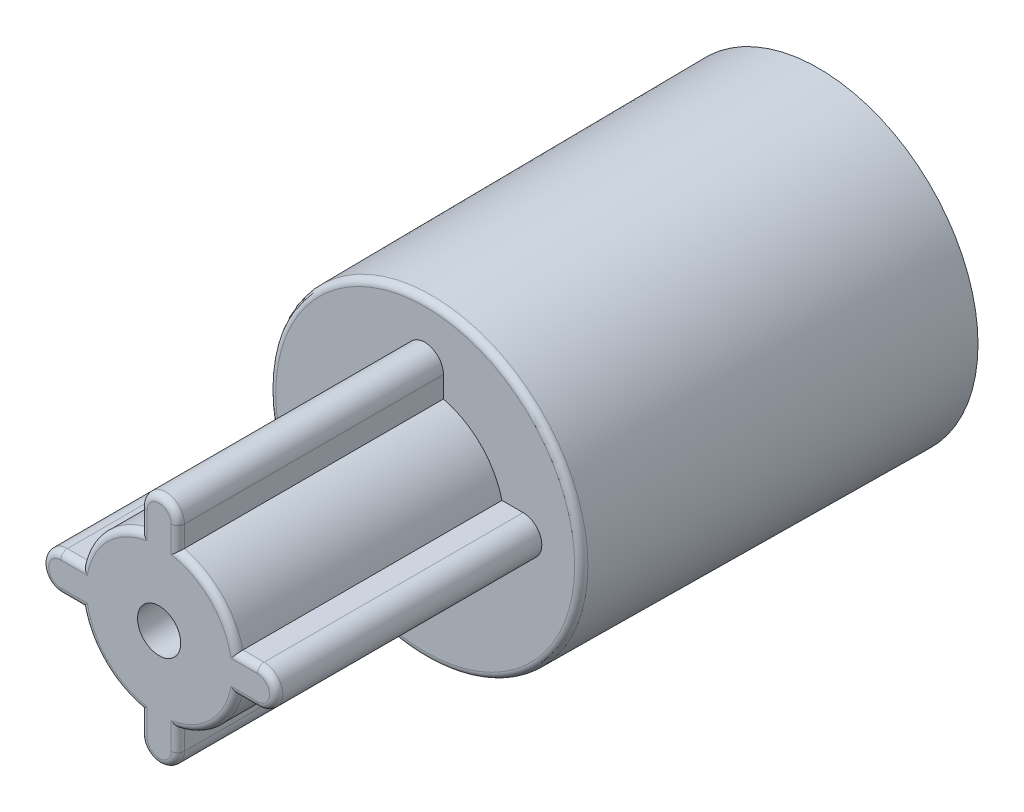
from build123d import *

# Parameters (mm, degrees)
SKETCH1_R           = 9.6
BASE_EXTRUDE_DEPTH  = 23.7
CUT_EXTRUDE1_DEPTH  = 21.7
BOSS_EXTRUDE1_DEPTH = 16
SKETCH4_R           = 1.3
CUT_EXTRUDE2_DEPTH  = 42.957240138
FILLET4_R           = 0.4


with BuildPart() as part:
    # Sketch1 → Base-Extrude (new body)
    with BuildSketch(Plane.XY):
        Circle(SKETCH1_R)
    extrude(amount=BASE_EXTRUDE_DEPTH)

    # Sketch2 → Cut-Extrude1 (cut)
    with BuildSketch(Plane(origin=(0, 0, 0), x_dir=(-1, 0, 0), z_dir=(0, 0, -1))):
        with BuildLine():
            Line((1.151331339, 6.016608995), (1.151331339, 4.741608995))
            ThreePointArc((1.151331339, 4.741608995), (3.409837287, 3.474244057), (4.677202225, 1.215738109))
            Line((4.677202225, 1.215738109), (5.952202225, 1.215738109))
            ThreePointArc((5.952202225, 1.215738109), (6.747697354, 0.886233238), (7.077202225, 0.090738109))
            ThreePointArc((7.077202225, 0.090738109), (6.747697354, -0.70475702), (5.952202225, -1.034261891))
            Line((5.952202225, -1.034261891), (4.677202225, -1.034261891))
            ThreePointArc((4.677202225, -1.034261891), (3.409837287, -3.292767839), (1.151331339, -4.560132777))
            Line((1.151331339, -4.560132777), (1.151331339, -5.835132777))
            ThreePointArc((1.151331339, -5.835132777), (0.026331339, -6.960132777), (-1.098668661, -5.835132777))
            Line((-1.098668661, -5.835132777), (-1.098668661, -4.560132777))
            ThreePointArc((-1.098668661, -4.560132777), (-3.357174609, -3.292767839), (-4.624539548, -1.034261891))
            Line((-4.624539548, -1.034261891), (-5.899539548, -1.034261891))
            ThreePointArc((-5.899539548, -1.034261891), (-6.695034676, -0.70475702), (-7.024539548, 0.090738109))
            ThreePointArc((-7.024539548, 0.090738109), (-6.695034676, 0.886233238), (-5.899539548, 1.215738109))
            Line((-5.899539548, 1.215738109), (-4.624539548, 1.215738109))
            ThreePointArc((-4.624539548, 1.215738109), (-3.357174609, 3.474244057), (-1.098668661, 4.741608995))
            Line((-1.098668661, 4.741608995), (-1.098668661, 6.016608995))
            ThreePointArc((-1.098668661, 6.016608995), (-0.76916379, 6.812104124), (0.026331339, 7.141608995))
            ThreePointArc((0.026331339, 7.141608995), (0.821826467, 6.812104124), (1.151331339, 6.016608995))
        make_face()
    extrude(amount=-CUT_EXTRUDE1_DEPTH, mode=Mode.SUBTRACT)

    # Sketch3 → Boss-Extrude1 (add)
    with BuildSketch(Plane.XY.offset(23.7)):
        with BuildLine():
            Line((-1.151331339, 6.016608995), (-1.151331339, 4.741608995))
            ThreePointArc((-1.151331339, 4.741608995), (-3.409837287, 3.474244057), (-4.677202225, 1.215738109))
            Line((-4.677202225, 1.215738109), (-5.952202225, 1.215738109))
            ThreePointArc((-5.952202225, 1.215738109), (-6.747697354, 0.886233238), (-7.077202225, 0.090738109))
            ThreePointArc((-7.077202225, 0.090738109), (-6.747697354, -0.70475702), (-5.952202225, -1.034261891))
            Line((-5.952202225, -1.034261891), (-4.677202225, -1.034261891))
            ThreePointArc((-4.677202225, -1.034261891), (-3.409837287, -3.292767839), (-1.151331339, -4.560132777))
            Line((-1.151331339, -4.560132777), (-1.151331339, -5.835132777))
            ThreePointArc((-1.151331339, -5.835132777), (-0.026331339, -6.960132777), (1.098668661, -5.835132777))
            Line((1.098668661, -5.835132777), (1.098668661, -4.560132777))
            ThreePointArc((1.098668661, -4.560132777), (3.357174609, -3.292767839), (4.624539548, -1.034261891))
            Line((4.624539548, -1.034261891), (5.899539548, -1.034261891))
            ThreePointArc((5.899539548, -1.034261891), (6.695034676, -0.70475702), (7.024539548, 0.090738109))
            ThreePointArc((7.024539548, 0.090738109), (6.695034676, 0.886233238), (5.899539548, 1.215738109))
            Line((5.899539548, 1.215738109), (4.624539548, 1.215738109))
            ThreePointArc((4.624539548, 1.215738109), (3.357174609, 3.474244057), (1.098668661, 4.741608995))
            Line((1.098668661, 4.741608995), (1.098668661, 6.016608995))
            ThreePointArc((1.098668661, 6.016608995), (0.76916379, 6.812104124), (-0.026331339, 7.141608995))
            ThreePointArc((-0.026331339, 7.141608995), (-0.821826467, 6.812104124), (-1.151331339, 6.016608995))
        make_face()
    extrude(amount=BOSS_EXTRUDE1_DEPTH)

    # Sketch4 → Cut-Extrude2 (cut, through all)
    with BuildSketch(Plane.XY.offset(39.7)):
        with Locations((-0.026331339, 0.090738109)):
            Circle(SKETCH4_R)
    extrude(amount=-CUT_EXTRUDE2_DEPTH, mode=Mode.SUBTRACT)

    # Sketch5 → Cut-Revolve1 (revolve, cut)
    with BuildSketch(Plane(origin=(0, 0, 0), x_dir=(0, 0, -1), z_dir=(1, 0, 0)), mode=Mode.PRIVATE) as cut_revolve1_sk:
        Polygon((0, 9.6), (-23.7, 9.4), (-23.7, 9.6), align=None)
    revolve(cut_revolve1_sk.sketch.rotate(Axis((0, 0, 0), (0, 0, 1)), 90), axis=Axis((0, 0, 0), (0, 0, 1)), mode=Mode.SUBTRACT)

    # Fillet4
    fillet4_edges = [part.edges().sort_by_distance(p)[0] for p in [
        (5.262039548, 1.215738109, 39.7),
        (7.024539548, 0.090738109, 39.7),
        (3.357174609, 3.474244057, 39.7),
        (5.262039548, -1.034261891, 39.7),
        (1.098668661, 5.379108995, 39.7),
        (3.357174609, -3.292767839, 39.7),
        (-0.026331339, 7.141608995, 39.7),
        (1.098668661, -5.197632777, 39.7),
        (-1.151331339, 5.379108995, 39.7),
        (-0.026331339, -6.960132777, 39.7),
        (-3.409837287, 3.474244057, 39.7),
        (-1.151331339, -5.197632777, 39.7),
        (-5.314702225, 1.215738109, 39.7),
        (-3.409837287, -3.292767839, 39.7),
        (-7.077202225, 0.090738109, 39.7),
        (-5.314702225, -1.034261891, 39.7),
        (9.4, 0, 23.7),
    ]]
    fillet(fillet4_edges, radius=FILLET4_R)


solid = part.part
